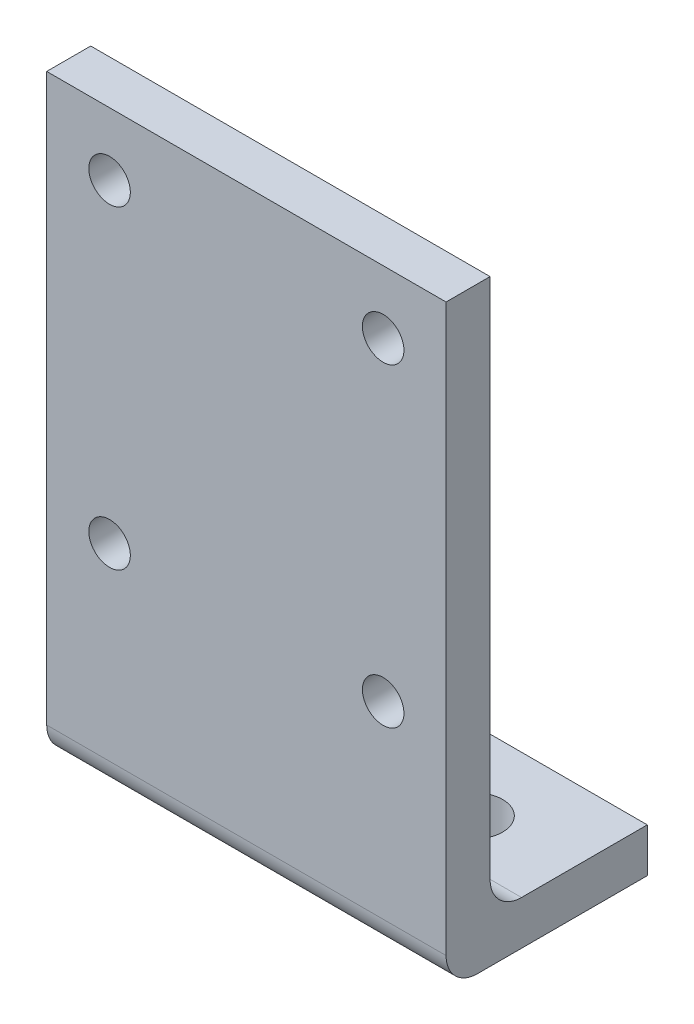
from build123d import *

# Parameters (mm, degrees)
SKETCH1_W            = 63.5
SKETCH1_H            = 95
EXTRUDE1_DEPTH       = 7
SKETCH3_W            = 63.5
SKETCH3_H            = 7
EXTRUDE3_DEPTH       = 25
M6_CLEARANCE_HOLE1_D = 6.6
M8_CLEARANCE_HOLE1_D = 9
FILLET1_R            = 5
FILLET2_R            = 5


with BuildPart() as part:
    # Sketch1 → Extrude1 (new body)
    with BuildSketch(Plane.XY):
        Rectangle(SKETCH1_W, SKETCH1_H)
    extrude(amount=EXTRUDE1_DEPTH)

    # Sketch3 → Extrude3 (add)
    with BuildSketch(Plane(origin=(0, 0, 0), x_dir=(-1, 0, 0), z_dir=(0, 0, -1))):
        with Locations((0, -44)):
            Rectangle(SKETCH3_W, SKETCH3_H)
    extrude(amount=EXTRUDE3_DEPTH)

    # M6 Clearance Hole1 (through all)
    with Locations(Plane(origin=(0, -31.875, 7), x_dir=(1, 0, 0), z_dir=(0, 0, 1))):
        with Locations((-21.75, 69.375), (21.75, 69.375), (21.75, 19.375), (-21.75, 19.375)):
            Hole(M6_CLEARANCE_HOLE1_D / 2)

    # M8 Clearance Hole1 (through all)
    with Locations(Plane(origin=(0, -40.5, 13.35), x_dir=(-1, 0, 0), z_dir=(0, 1, 0))):
        with Locations((16.75, -25.85), (-16.75, -25.85)):
            Hole(M8_CLEARANCE_HOLE1_D / 2)

    # Fillet1
    fillet1_edges = [part.edges().sort_by_distance(p)[0] for p in [
        (0, -47.5, 7),
    ]]
    fillet(fillet1_edges, radius=FILLET1_R)

    # Fillet2
    fillet2_edges = [part.edges().sort_by_distance(p)[0] for p in [
        (0, -40.5, 0),
    ]]
    fillet(fillet2_edges, radius=FILLET2_R)


solid = part.part
